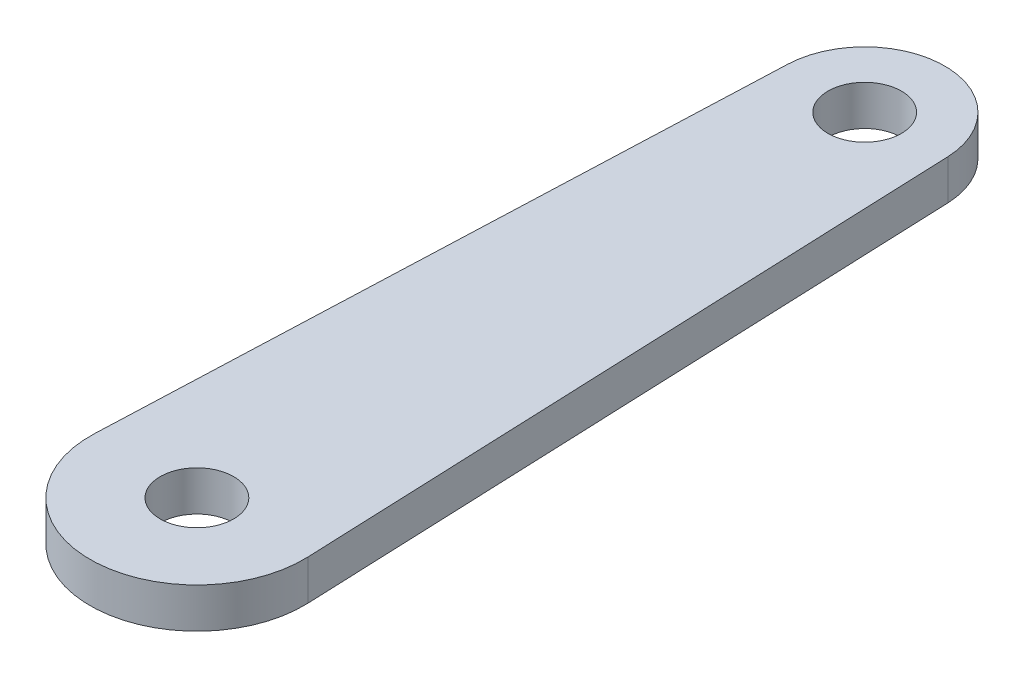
ISO-10303-21;
HEADER;
FILE_DESCRIPTION(('STEP AP214'),'2;1');
FILE_NAME('part.step','',(''),(''),'','','');
FILE_SCHEMA(('AUTOMOTIVE_DESIGN { 1 0 10303 214 1 1 1 1 }'));
ENDSEC;
DATA;
#1=APPLICATION_CONTEXT('core data for automotive mechanical design processes');
#2=APPLICATION_PROTOCOL_DEFINITION('international standard','automotive_design',2000,#1);
#3=PRODUCT_CONTEXT('',#1,'mechanical');
#4=PRODUCT('Part','Part','',(#3));
#5=PRODUCT_RELATED_PRODUCT_CATEGORY('part','',(#4));
#6=PRODUCT_DEFINITION_FORMATION('','',#4);
#7=PRODUCT_DEFINITION_CONTEXT('part definition',#1,'design');
#8=PRODUCT_DEFINITION('design','',#6,#7);
#9=PRODUCT_DEFINITION_SHAPE('','',#8);
#10=(LENGTH_UNIT() NAMED_UNIT(*) SI_UNIT(.MILLI.,.METRE.));
#11=(NAMED_UNIT(*) PLANE_ANGLE_UNIT() SI_UNIT($,.RADIAN.));
#12=(NAMED_UNIT(*) SI_UNIT($,.STERADIAN.) SOLID_ANGLE_UNIT());
#13=UNCERTAINTY_MEASURE_WITH_UNIT(LENGTH_MEASURE(1.E-05),#10,'distance_accuracy_value','');
#14=(GEOMETRIC_REPRESENTATION_CONTEXT(3) GLOBAL_UNCERTAINTY_ASSIGNED_CONTEXT((#13)) GLOBAL_UNIT_ASSIGNED_CONTEXT((#10,
#11,#12)) REPRESENTATION_CONTEXT('',''));
#15=CARTESIAN_POINT('',(0.,0.,0.));
#16=DIRECTION('',(0.,0.,1.));
#17=DIRECTION('',(1.,0.,0.));
#18=AXIS2_PLACEMENT_3D('',#15,#16,#17);
#19=CARTESIAN_POINT('',(0.,3.,-50.));
#20=DIRECTION('',(0.,1.,0.));
#21=DIRECTION('',(0.,0.,1.));
#22=AXIS2_PLACEMENT_3D('',#19,#20,#21);
#23=PLANE('',#22);
#24=CARTESIAN_POINT('',(0.,3.,-50.));
#25=DIRECTION('',(0.,1.,0.));
#26=DIRECTION('',(0.,0.,1.));
#27=AXIS2_PLACEMENT_3D('',#24,#25,#26);
#28=CIRCLE('',#27,2.75);
#29=CARTESIAN_POINT('',(0.,3.,-47.25));
#30=VERTEX_POINT('',#29);
#31=EDGE_CURVE('E89',#30,#30,#28,.T.);
#32=ORIENTED_EDGE('',*,*,#31,.F.);
#33=EDGE_LOOP('',(#32));
#34=FACE_BOUND('',#33,.T.);
#35=CARTESIAN_POINT('',(0.,3.,-50.));
#36=DIRECTION('',(0.,1.,0.));
#37=DIRECTION('',(0.,0.,1.));
#38=AXIS2_PLACEMENT_3D('',#35,#36,#37);
#39=CIRCLE('',#38,6.);
#40=CARTESIAN_POINT('',(5.99519807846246,3.,-50.24));
#41=VERTEX_POINT('',#40);
#42=CARTESIAN_POINT('',(-5.99519807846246,3.,-50.24));
#43=VERTEX_POINT('',#42);
#44=EDGE_CURVE('E99',#41,#43,#39,.T.);
#45=ORIENTED_EDGE('',*,*,#44,.T.);
#46=DIRECTION('',(-0.04,0.,0.999199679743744));
#47=VECTOR('',#46,1.);
#48=CARTESIAN_POINT('',(-5.99519807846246,3.,-50.24));
#49=LINE('',#48,#47);
#50=CARTESIAN_POINT('',(-7.99359743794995,3.,-0.320000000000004));
#51=VERTEX_POINT('',#50);
#52=EDGE_CURVE('E84',#43,#51,#49,.T.);
#53=ORIENTED_EDGE('',*,*,#52,.T.);
#54=CARTESIAN_POINT('',(0.,3.,0.));
#55=DIRECTION('',(0.,1.,0.));
#56=DIRECTION('',(0.,0.,1.));
#57=AXIS2_PLACEMENT_3D('',#54,#55,#56);
#58=CIRCLE('',#57,8.);
#59=CARTESIAN_POINT('',(7.99359743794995,3.,-0.32));
#60=VERTEX_POINT('',#59);
#61=EDGE_CURVE('E50',#51,#60,#58,.T.);
#62=ORIENTED_EDGE('',*,*,#61,.T.);
#63=DIRECTION('',(-0.04,0.,-0.999199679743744));
#64=VECTOR('',#63,1.);
#65=CARTESIAN_POINT('',(5.99519807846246,3.,-50.24));
#66=LINE('',#65,#64);
#67=EDGE_CURVE('E45',#60,#41,#66,.T.);
#68=ORIENTED_EDGE('',*,*,#67,.T.);
#69=EDGE_LOOP('',(#45,#53,#62,#68));
#70=FACE_BOUND('',#69,.T.);
#71=CARTESIAN_POINT('',(0.,3.,0.));
#72=DIRECTION('',(0.,1.,0.));
#73=DIRECTION('',(0.,0.,1.));
#74=AXIS2_PLACEMENT_3D('',#71,#72,#73);
#75=CIRCLE('',#74,2.75);
#76=CARTESIAN_POINT('',(0.,3.,2.75));
#77=VERTEX_POINT('',#76);
#78=EDGE_CURVE('E117',#77,#77,#75,.T.);
#79=ORIENTED_EDGE('',*,*,#78,.F.);
#80=EDGE_LOOP('',(#79));
#81=FACE_BOUND('',#80,.T.);
#82=ADVANCED_FACE('F30',(#34,#70,#81),#23,.T.);
#83=CARTESIAN_POINT('',(0.,0.,-50.));
#84=DIRECTION('',(0.,1.,0.));
#85=DIRECTION('',(0.,0.,1.));
#86=AXIS2_PLACEMENT_3D('',#83,#84,#85);
#87=PLANE('',#86);
#88=CARTESIAN_POINT('',(0.,0.,-50.));
#89=DIRECTION('',(0.,1.,0.));
#90=DIRECTION('',(0.,0.,1.));
#91=AXIS2_PLACEMENT_3D('',#88,#89,#90);
#92=CIRCLE('',#91,2.75);
#93=CARTESIAN_POINT('',(0.,0.,-47.25));
#94=VERTEX_POINT('',#93);
#95=EDGE_CURVE('E92',#94,#94,#92,.T.);
#96=ORIENTED_EDGE('',*,*,#95,.T.);
#97=EDGE_LOOP('',(#96));
#98=FACE_BOUND('',#97,.T.);
#99=CARTESIAN_POINT('',(0.,0.,-50.));
#100=DIRECTION('',(0.,1.,0.));
#101=DIRECTION('',(0.,0.,1.));
#102=AXIS2_PLACEMENT_3D('',#99,#100,#101);
#103=CIRCLE('',#102,6.);
#104=CARTESIAN_POINT('',(5.99519807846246,0.,-50.24));
#105=VERTEX_POINT('',#104);
#106=CARTESIAN_POINT('',(-5.99519807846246,0.,-50.24));
#107=VERTEX_POINT('',#106);
#108=EDGE_CURVE('E76',#105,#107,#103,.T.);
#109=ORIENTED_EDGE('',*,*,#108,.F.);
#110=DIRECTION('',(-0.04,0.,-0.999199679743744));
#111=VECTOR('',#110,1.);
#112=CARTESIAN_POINT('',(5.99519807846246,0.,-50.24));
#113=LINE('',#112,#111);
#114=CARTESIAN_POINT('',(7.99359743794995,0.,-0.32));
#115=VERTEX_POINT('',#114);
#116=EDGE_CURVE('E97',#115,#105,#113,.T.);
#117=ORIENTED_EDGE('',*,*,#116,.F.);
#118=CARTESIAN_POINT('',(0.,0.,0.));
#119=DIRECTION('',(0.,1.,0.));
#120=DIRECTION('',(0.,0.,1.));
#121=AXIS2_PLACEMENT_3D('',#118,#119,#120);
#122=CIRCLE('',#121,8.);
#123=CARTESIAN_POINT('',(-7.99359743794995,0.,-0.320000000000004));
#124=VERTEX_POINT('',#123);
#125=EDGE_CURVE('E77',#124,#115,#122,.T.);
#126=ORIENTED_EDGE('',*,*,#125,.F.);
#127=DIRECTION('',(-0.04,0.,0.999199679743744));
#128=VECTOR('',#127,1.);
#129=CARTESIAN_POINT('',(-5.99519807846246,0.,-50.24));
#130=LINE('',#129,#128);
#131=EDGE_CURVE('E71',#107,#124,#130,.T.);
#132=ORIENTED_EDGE('',*,*,#131,.F.);
#133=EDGE_LOOP('',(#109,#117,#126,#132));
#134=FACE_BOUND('',#133,.T.);
#135=CARTESIAN_POINT('',(0.,0.,0.));
#136=DIRECTION('',(0.,1.,0.));
#137=DIRECTION('',(0.,0.,1.));
#138=AXIS2_PLACEMENT_3D('',#135,#136,#137);
#139=CIRCLE('',#138,2.75);
#140=CARTESIAN_POINT('',(0.,0.,2.75));
#141=VERTEX_POINT('',#140);
#142=EDGE_CURVE('E119',#141,#141,#139,.T.);
#143=ORIENTED_EDGE('',*,*,#142,.T.);
#144=EDGE_LOOP('',(#143));
#145=FACE_BOUND('',#144,.T.);
#146=ADVANCED_FACE('F72',(#98,#134,#145),#87,.F.);
#147=CARTESIAN_POINT('',(0.,3.,-50.));
#148=DIRECTION('',(0.,-1.,0.));
#149=DIRECTION('',(0.,0.,-1.));
#150=AXIS2_PLACEMENT_3D('',#147,#148,#149);
#151=CYLINDRICAL_SURFACE('',#150,6.);
#152=ORIENTED_EDGE('',*,*,#108,.T.);
#153=DIRECTION('',(0.,-1.,0.));
#154=VECTOR('',#153,1.);
#155=CARTESIAN_POINT('',(-5.99519807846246,3.,-50.24));
#156=LINE('',#155,#154);
#157=EDGE_CURVE('E11',#43,#107,#156,.T.);
#158=ORIENTED_EDGE('',*,*,#157,.F.);
#159=ORIENTED_EDGE('',*,*,#44,.F.);
#160=DIRECTION('',(0.,-1.,0.));
#161=VECTOR('',#160,1.);
#162=CARTESIAN_POINT('',(5.99519807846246,3.,-50.24));
#163=LINE('',#162,#161);
#164=EDGE_CURVE('E88',#41,#105,#163,.T.);
#165=ORIENTED_EDGE('',*,*,#164,.T.);
#166=EDGE_LOOP('',(#152,#158,#159,#165));
#167=FACE_BOUND('',#166,.T.);
#168=ADVANCED_FACE('F32',(#167),#151,.T.);
#169=CARTESIAN_POINT('',(-5.99519807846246,3.,-50.24));
#170=DIRECTION('',(0.999199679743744,0.,0.04));
#171=DIRECTION('',(0.04,0.,-0.999199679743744));
#172=AXIS2_PLACEMENT_3D('',#169,#170,#171);
#173=PLANE('',#172);
#174=ORIENTED_EDGE('',*,*,#131,.T.);
#175=DIRECTION('',(0.,-1.,0.));
#176=VECTOR('',#175,1.);
#177=CARTESIAN_POINT('',(-7.99359743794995,3.,-0.320000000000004));
#178=LINE('',#177,#176);
#179=EDGE_CURVE('E38',#51,#124,#178,.T.);
#180=ORIENTED_EDGE('',*,*,#179,.F.);
#181=ORIENTED_EDGE('',*,*,#52,.F.);
#182=ORIENTED_EDGE('',*,*,#157,.T.);
#183=EDGE_LOOP('',(#174,#180,#181,#182));
#184=FACE_BOUND('',#183,.T.);
#185=ADVANCED_FACE('F83',(#184),#173,.F.);
#186=CARTESIAN_POINT('',(0.,3.,0.));
#187=DIRECTION('',(0.,-1.,0.));
#188=DIRECTION('',(0.,0.,-1.));
#189=AXIS2_PLACEMENT_3D('',#186,#187,#188);
#190=CYLINDRICAL_SURFACE('',#189,8.);
#191=ORIENTED_EDGE('',*,*,#125,.T.);
#192=DIRECTION('',(0.,-1.,0.));
#193=VECTOR('',#192,1.);
#194=CARTESIAN_POINT('',(7.99359743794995,3.,-0.32));
#195=LINE('',#194,#193);
#196=EDGE_CURVE('E105',#60,#115,#195,.T.);
#197=ORIENTED_EDGE('',*,*,#196,.F.);
#198=ORIENTED_EDGE('',*,*,#61,.F.);
#199=ORIENTED_EDGE('',*,*,#179,.T.);
#200=EDGE_LOOP('',(#191,#197,#198,#199));
#201=FACE_BOUND('',#200,.T.);
#202=ADVANCED_FACE('F108',(#201),#190,.T.);
#203=CARTESIAN_POINT('',(5.99519807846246,3.,-50.24));
#204=DIRECTION('',(-0.999199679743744,0.,0.04));
#205=DIRECTION('',(0.04,0.,0.999199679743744));
#206=AXIS2_PLACEMENT_3D('',#203,#204,#205);
#207=PLANE('',#206);
#208=ORIENTED_EDGE('',*,*,#116,.T.);
#209=ORIENTED_EDGE('',*,*,#164,.F.);
#210=ORIENTED_EDGE('',*,*,#67,.F.);
#211=ORIENTED_EDGE('',*,*,#196,.T.);
#212=EDGE_LOOP('',(#208,#209,#210,#211));
#213=FACE_BOUND('',#212,.T.);
#214=ADVANCED_FACE('F110',(#213),#207,.F.);
#215=CARTESIAN_POINT('',(0.,3.,-50.));
#216=DIRECTION('',(0.,-1.,0.));
#217=DIRECTION('',(0.,0.,-1.));
#218=AXIS2_PLACEMENT_3D('',#215,#216,#217);
#219=CYLINDRICAL_SURFACE('',#218,2.75);
#220=ORIENTED_EDGE('',*,*,#31,.T.);
#221=EDGE_LOOP('',(#220));
#222=FACE_BOUND('',#221,.T.);
#223=ORIENTED_EDGE('',*,*,#95,.F.);
#224=EDGE_LOOP('',(#223));
#225=FACE_BOUND('',#224,.T.);
#226=ADVANCED_FACE('F128',(#222,#225),#219,.F.);
#227=CARTESIAN_POINT('',(0.,3.,0.));
#228=DIRECTION('',(0.,-1.,0.));
#229=DIRECTION('',(0.,0.,-1.));
#230=AXIS2_PLACEMENT_3D('',#227,#228,#229);
#231=CYLINDRICAL_SURFACE('',#230,2.75);
#232=ORIENTED_EDGE('',*,*,#78,.T.);
#233=EDGE_LOOP('',(#232));
#234=FACE_BOUND('',#233,.T.);
#235=ORIENTED_EDGE('',*,*,#142,.F.);
#236=EDGE_LOOP('',(#235));
#237=FACE_BOUND('',#236,.T.);
#238=ADVANCED_FACE('F126',(#234,#237),#231,.F.);
#239=CLOSED_SHELL('',(#82,#146,#168,#185,#202,#214,#226,#238));
#240=MANIFOLD_SOLID_BREP('B2',#239);
#241=ADVANCED_BREP_SHAPE_REPRESENTATION('',(#18,#240),#14);
#242=SHAPE_DEFINITION_REPRESENTATION(#9,#241);
ENDSEC;
END-ISO-10303-21;
